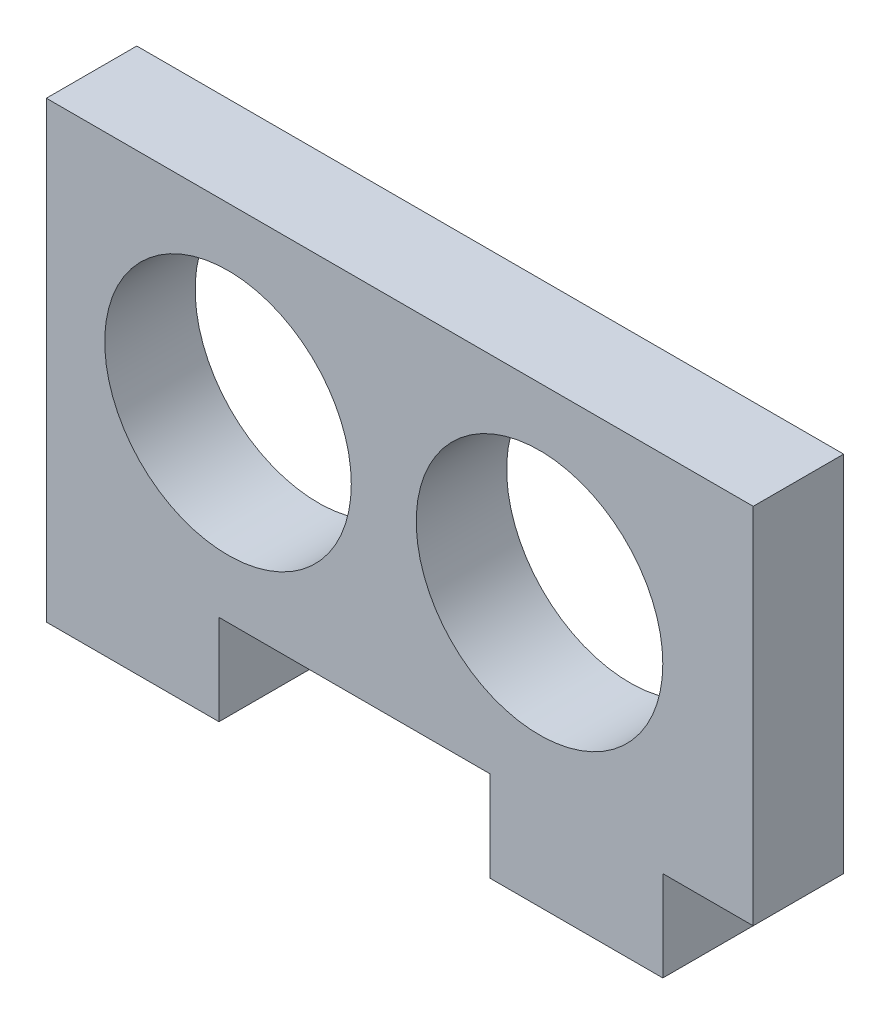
ISO-10303-21;
HEADER;
FILE_DESCRIPTION(('STEP AP214'),'2;1');
FILE_NAME('part.step','',(''),(''),'','','');
FILE_SCHEMA(('AUTOMOTIVE_DESIGN { 1 0 10303 214 1 1 1 1 }'));
ENDSEC;
DATA;
#1=APPLICATION_CONTEXT('core data for automotive mechanical design processes');
#2=APPLICATION_PROTOCOL_DEFINITION('international standard','automotive_design',2000,#1);
#3=PRODUCT_CONTEXT('',#1,'mechanical');
#4=PRODUCT('Part','Part','',(#3));
#5=PRODUCT_RELATED_PRODUCT_CATEGORY('part','',(#4));
#6=PRODUCT_DEFINITION_FORMATION('','',#4);
#7=PRODUCT_DEFINITION_CONTEXT('part definition',#1,'design');
#8=PRODUCT_DEFINITION('design','',#6,#7);
#9=PRODUCT_DEFINITION_SHAPE('','',#8);
#10=(LENGTH_UNIT() NAMED_UNIT(*) SI_UNIT(.MILLI.,.METRE.));
#11=(NAMED_UNIT(*) PLANE_ANGLE_UNIT() SI_UNIT($,.RADIAN.));
#12=(NAMED_UNIT(*) SI_UNIT($,.STERADIAN.) SOLID_ANGLE_UNIT());
#13=UNCERTAINTY_MEASURE_WITH_UNIT(LENGTH_MEASURE(1.E-05),#10,'distance_accuracy_value','');
#14=(GEOMETRIC_REPRESENTATION_CONTEXT(3) GLOBAL_UNCERTAINTY_ASSIGNED_CONTEXT((#13)) GLOBAL_UNIT_ASSIGNED_CONTEXT((#10,
#11,#12)) REPRESENTATION_CONTEXT('',''));
#15=CARTESIAN_POINT('',(0.,0.,0.));
#16=DIRECTION('',(0.,0.,1.));
#17=DIRECTION('',(1.,0.,0.));
#18=AXIS2_PLACEMENT_3D('',#15,#16,#17);
#19=CARTESIAN_POINT('',(0.,0.,5.5));
#20=DIRECTION('',(0.,0.,1.));
#21=DIRECTION('',(1.,0.,0.));
#22=AXIS2_PLACEMENT_3D('',#19,#20,#21);
#23=PLANE('',#22);
#24=CARTESIAN_POINT('',(-26.3312728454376,16.55,5.5));
#25=DIRECTION('',(0.,0.,1.));
#26=DIRECTION('',(1.,0.,0.));
#27=AXIS2_PLACEMENT_3D('',#24,#25,#26);
#28=CIRCLE('',#27,7.5);
#29=CARTESIAN_POINT('',(-18.8312728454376,16.55,5.5));
#30=VERTEX_POINT('',#29);
#31=EDGE_CURVE('E152',#30,#30,#28,.T.);
#32=ORIENTED_EDGE('',*,*,#31,.F.);
#33=EDGE_LOOP('',(#32));
#34=FACE_BOUND('',#33,.T.);
#35=DIRECTION('',(1.,0.,0.));
#36=VECTOR('',#35,1.);
#37=CARTESIAN_POINT('',(0.118727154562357,0.,5.5));
#38=LINE('',#37,#36);
#39=CARTESIAN_POINT('',(-10.3812728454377,0.,5.5));
#40=VERTEX_POINT('',#39);
#41=CARTESIAN_POINT('',(0.118727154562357,0.,5.5));
#42=VERTEX_POINT('',#41);
#43=EDGE_CURVE('E53',#40,#42,#38,.T.);
#44=ORIENTED_EDGE('',*,*,#43,.T.);
#45=DIRECTION('',(0.,1.,0.));
#46=VECTOR('',#45,1.);
#47=CARTESIAN_POINT('',(0.118727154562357,5.5,5.5));
#48=LINE('',#47,#46);
#49=CARTESIAN_POINT('',(0.118727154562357,5.5,5.5));
#50=VERTEX_POINT('',#49);
#51=EDGE_CURVE('E103',#42,#50,#48,.T.);
#52=ORIENTED_EDGE('',*,*,#51,.T.);
#53=DIRECTION('',(1.,0.,0.));
#54=VECTOR('',#53,1.);
#55=CARTESIAN_POINT('',(5.61872715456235,5.5,5.5));
#56=LINE('',#55,#54);
#57=CARTESIAN_POINT('',(5.61872715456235,5.5,5.5));
#58=VERTEX_POINT('',#57);
#59=EDGE_CURVE('E189',#50,#58,#56,.T.);
#60=ORIENTED_EDGE('',*,*,#59,.T.);
#61=DIRECTION('',(0.,1.,0.));
#62=VECTOR('',#61,1.);
#63=CARTESIAN_POINT('',(5.61872715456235,13.3164696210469,5.5));
#64=LINE('',#63,#62);
#65=CARTESIAN_POINT('',(5.61872715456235,27.6,5.5));
#66=VERTEX_POINT('',#65);
#67=EDGE_CURVE('E207',#58,#66,#64,.T.);
#68=ORIENTED_EDGE('',*,*,#67,.T.);
#69=DIRECTION('',(-1.,0.,0.));
#70=VECTOR('',#69,1.);
#71=CARTESIAN_POINT('',(0.11872715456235,27.6,5.5));
#72=LINE('',#71,#70);
#73=CARTESIAN_POINT('',(-37.3812728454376,27.6,5.5));
#74=VERTEX_POINT('',#73);
#75=EDGE_CURVE('E204',#66,#74,#72,.T.);
#76=ORIENTED_EDGE('',*,*,#75,.T.);
#77=DIRECTION('',(0.,-1.,0.));
#78=VECTOR('',#77,1.);
#79=CARTESIAN_POINT('',(-37.3812728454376,27.6,5.5));
#80=LINE('',#79,#78);
#81=CARTESIAN_POINT('',(-37.3812728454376,0.,5.5));
#82=VERTEX_POINT('',#81);
#83=EDGE_CURVE('E206',#74,#82,#80,.T.);
#84=ORIENTED_EDGE('',*,*,#83,.T.);
#85=DIRECTION('',(1.,0.,0.));
#86=VECTOR('',#85,1.);
#87=CARTESIAN_POINT('',(-37.3812728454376,0.,5.5));
#88=LINE('',#87,#86);
#89=CARTESIAN_POINT('',(-26.8812728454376,0.,5.5));
#90=VERTEX_POINT('',#89);
#91=EDGE_CURVE('E129',#82,#90,#88,.T.);
#92=ORIENTED_EDGE('',*,*,#91,.T.);
#93=DIRECTION('',(0.,1.,0.));
#94=VECTOR('',#93,1.);
#95=CARTESIAN_POINT('',(-26.8812728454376,0.,5.5));
#96=LINE('',#95,#94);
#97=CARTESIAN_POINT('',(-26.8812728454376,5.5,5.5));
#98=VERTEX_POINT('',#97);
#99=EDGE_CURVE('E123',#90,#98,#96,.T.);
#100=ORIENTED_EDGE('',*,*,#99,.T.);
#101=DIRECTION('',(1.,0.,0.));
#102=VECTOR('',#101,1.);
#103=CARTESIAN_POINT('',(-26.8812728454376,5.5,5.5));
#104=LINE('',#103,#102);
#105=CARTESIAN_POINT('',(-10.3812728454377,5.5,5.5));
#106=VERTEX_POINT('',#105);
#107=EDGE_CURVE('E127',#98,#106,#104,.T.);
#108=ORIENTED_EDGE('',*,*,#107,.T.);
#109=DIRECTION('',(0.,-1.,0.));
#110=VECTOR('',#109,1.);
#111=CARTESIAN_POINT('',(-10.3812728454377,5.5,5.5));
#112=LINE('',#111,#110);
#113=EDGE_CURVE('E143',#106,#40,#112,.T.);
#114=ORIENTED_EDGE('',*,*,#113,.T.);
#115=EDGE_LOOP('',(#44,#52,#60,#68,#76,#84,#92,#100,#108,#114));
#116=FACE_BOUND('',#115,.T.);
#117=CARTESIAN_POINT('',(-7.38127284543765,16.55,5.5));
#118=DIRECTION('',(0.,0.,1.));
#119=DIRECTION('',(1.,0.,0.));
#120=AXIS2_PLACEMENT_3D('',#117,#118,#119);
#121=CIRCLE('',#120,7.5);
#122=CARTESIAN_POINT('',(0.118727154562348,16.55,5.5));
#123=VERTEX_POINT('',#122);
#124=EDGE_CURVE('E218',#123,#123,#121,.T.);
#125=ORIENTED_EDGE('',*,*,#124,.F.);
#126=EDGE_LOOP('',(#125));
#127=FACE_BOUND('',#126,.T.);
#128=ADVANCED_FACE('F36',(#34,#116,#127),#23,.T.);
#129=CARTESIAN_POINT('',(0.,0.,0.));
#130=DIRECTION('',(0.,0.,1.));
#131=DIRECTION('',(1.,0.,0.));
#132=AXIS2_PLACEMENT_3D('',#129,#130,#131);
#133=PLANE('',#132);
#134=DIRECTION('',(0.,1.,0.));
#135=VECTOR('',#134,1.);
#136=CARTESIAN_POINT('',(0.118727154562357,5.5,0.));
#137=LINE('',#136,#135);
#138=CARTESIAN_POINT('',(0.118727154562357,0.,0.));
#139=VERTEX_POINT('',#138);
#140=CARTESIAN_POINT('',(0.118727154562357,5.5,0.));
#141=VERTEX_POINT('',#140);
#142=EDGE_CURVE('E149',#139,#141,#137,.T.);
#143=ORIENTED_EDGE('',*,*,#142,.F.);
#144=DIRECTION('',(1.,0.,0.));
#145=VECTOR('',#144,1.);
#146=CARTESIAN_POINT('',(-10.3812728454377,0.,0.));
#147=LINE('',#146,#145);
#148=CARTESIAN_POINT('',(-10.3812728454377,0.,0.));
#149=VERTEX_POINT('',#148);
#150=EDGE_CURVE('E167',#149,#139,#147,.T.);
#151=ORIENTED_EDGE('',*,*,#150,.F.);
#152=DIRECTION('',(0.,-1.,0.));
#153=VECTOR('',#152,1.);
#154=CARTESIAN_POINT('',(-10.3812728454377,5.5,0.));
#155=LINE('',#154,#153);
#156=CARTESIAN_POINT('',(-10.3812728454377,5.5,0.));
#157=VERTEX_POINT('',#156);
#158=EDGE_CURVE('E96',#157,#149,#155,.T.);
#159=ORIENTED_EDGE('',*,*,#158,.F.);
#160=DIRECTION('',(1.,0.,0.));
#161=VECTOR('',#160,1.);
#162=CARTESIAN_POINT('',(-26.8812728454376,5.5,0.));
#163=LINE('',#162,#161);
#164=CARTESIAN_POINT('',(-26.8812728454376,5.5,0.));
#165=VERTEX_POINT('',#164);
#166=EDGE_CURVE('E89',#165,#157,#163,.T.);
#167=ORIENTED_EDGE('',*,*,#166,.F.);
#168=DIRECTION('',(0.,1.,0.));
#169=VECTOR('',#168,1.);
#170=CARTESIAN_POINT('',(-26.8812728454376,0.,0.));
#171=LINE('',#170,#169);
#172=CARTESIAN_POINT('',(-26.8812728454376,0.,0.));
#173=VERTEX_POINT('',#172);
#174=EDGE_CURVE('E137',#173,#165,#171,.T.);
#175=ORIENTED_EDGE('',*,*,#174,.F.);
#176=DIRECTION('',(1.,0.,0.));
#177=VECTOR('',#176,1.);
#178=CARTESIAN_POINT('',(-37.3812728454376,0.,0.));
#179=LINE('',#178,#177);
#180=CARTESIAN_POINT('',(-37.3812728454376,0.,0.));
#181=VERTEX_POINT('',#180);
#182=EDGE_CURVE('E162',#181,#173,#179,.T.);
#183=ORIENTED_EDGE('',*,*,#182,.F.);
#184=DIRECTION('',(0.,-1.,0.));
#185=VECTOR('',#184,1.);
#186=CARTESIAN_POINT('',(-37.3812728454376,27.6,0.));
#187=LINE('',#186,#185);
#188=CARTESIAN_POINT('',(-37.3812728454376,27.6,0.));
#189=VERTEX_POINT('',#188);
#190=EDGE_CURVE('E160',#189,#181,#187,.T.);
#191=ORIENTED_EDGE('',*,*,#190,.F.);
#192=DIRECTION('',(-1.,0.,0.));
#193=VECTOR('',#192,1.);
#194=CARTESIAN_POINT('',(-37.3812728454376,27.6,0.));
#195=LINE('',#194,#193);
#196=CARTESIAN_POINT('',(5.61872715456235,27.6,0.));
#197=VERTEX_POINT('',#196);
#198=EDGE_CURVE('E158',#197,#189,#195,.T.);
#199=ORIENTED_EDGE('',*,*,#198,.F.);
#200=DIRECTION('',(0.,1.,0.));
#201=VECTOR('',#200,1.);
#202=CARTESIAN_POINT('',(5.61872715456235,27.6,0.));
#203=LINE('',#202,#201);
#204=CARTESIAN_POINT('',(5.61872715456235,5.5,0.));
#205=VERTEX_POINT('',#204);
#206=EDGE_CURVE('E155',#205,#197,#203,.T.);
#207=ORIENTED_EDGE('',*,*,#206,.F.);
#208=DIRECTION('',(1.,0.,0.));
#209=VECTOR('',#208,1.);
#210=CARTESIAN_POINT('',(5.61872715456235,5.5,0.));
#211=LINE('',#210,#209);
#212=EDGE_CURVE('E151',#141,#205,#211,.T.);
#213=ORIENTED_EDGE('',*,*,#212,.F.);
#214=EDGE_LOOP('',(#143,#151,#159,#167,#175,#183,#191,#199,#207,#213));
#215=FACE_BOUND('',#214,.T.);
#216=CARTESIAN_POINT('',(-26.3312728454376,16.55,0.));
#217=DIRECTION('',(0.,0.,1.));
#218=DIRECTION('',(1.,0.,0.));
#219=AXIS2_PLACEMENT_3D('',#216,#217,#218);
#220=CIRCLE('',#219,7.5);
#221=CARTESIAN_POINT('',(-18.8312728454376,16.55,0.));
#222=VERTEX_POINT('',#221);
#223=EDGE_CURVE('E215',#222,#222,#220,.T.);
#224=ORIENTED_EDGE('',*,*,#223,.T.);
#225=EDGE_LOOP('',(#224));
#226=FACE_BOUND('',#225,.T.);
#227=CARTESIAN_POINT('',(-7.38127284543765,16.55,0.));
#228=DIRECTION('',(0.,0.,1.));
#229=DIRECTION('',(1.,0.,0.));
#230=AXIS2_PLACEMENT_3D('',#227,#228,#229);
#231=CIRCLE('',#230,7.5);
#232=CARTESIAN_POINT('',(0.118727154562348,16.55,0.));
#233=VERTEX_POINT('',#232);
#234=EDGE_CURVE('E221',#233,#233,#231,.T.);
#235=ORIENTED_EDGE('',*,*,#234,.T.);
#236=EDGE_LOOP('',(#235));
#237=FACE_BOUND('',#236,.T.);
#238=ADVANCED_FACE('F192',(#215,#226,#237),#133,.F.);
#239=CARTESIAN_POINT('',(0.118727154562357,5.5,5.5));
#240=DIRECTION('',(-1.,0.,0.));
#241=DIRECTION('',(0.,0.,1.));
#242=AXIS2_PLACEMENT_3D('',#239,#240,#241);
#243=PLANE('',#242);
#244=ORIENTED_EDGE('',*,*,#142,.T.);
#245=DIRECTION('',(0.,0.,-1.));
#246=VECTOR('',#245,1.);
#247=CARTESIAN_POINT('',(0.118727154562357,5.5,5.5));
#248=LINE('',#247,#246);
#249=EDGE_CURVE('E45',#50,#141,#248,.T.);
#250=ORIENTED_EDGE('',*,*,#249,.F.);
#251=ORIENTED_EDGE('',*,*,#51,.F.);
#252=DIRECTION('',(0.,0.,-1.));
#253=VECTOR('',#252,1.);
#254=CARTESIAN_POINT('',(0.118727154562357,0.,5.5));
#255=LINE('',#254,#253);
#256=EDGE_CURVE('E11',#42,#139,#255,.T.);
#257=ORIENTED_EDGE('',*,*,#256,.T.);
#258=EDGE_LOOP('',(#244,#250,#251,#257));
#259=FACE_BOUND('',#258,.T.);
#260=ADVANCED_FACE('F38',(#259),#243,.F.);
#261=CARTESIAN_POINT('',(5.61872715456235,5.5,5.5));
#262=DIRECTION('',(0.,1.,0.));
#263=DIRECTION('',(-1.,0.,0.));
#264=AXIS2_PLACEMENT_3D('',#261,#262,#263);
#265=PLANE('',#264);
#266=ORIENTED_EDGE('',*,*,#212,.T.);
#267=DIRECTION('',(0.,0.,-1.));
#268=VECTOR('',#267,1.);
#269=CARTESIAN_POINT('',(5.61872715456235,5.5,5.5));
#270=LINE('',#269,#268);
#271=EDGE_CURVE('E181',#58,#205,#270,.T.);
#272=ORIENTED_EDGE('',*,*,#271,.F.);
#273=ORIENTED_EDGE('',*,*,#59,.F.);
#274=ORIENTED_EDGE('',*,*,#249,.T.);
#275=EDGE_LOOP('',(#266,#272,#273,#274));
#276=FACE_BOUND('',#275,.T.);
#277=ADVANCED_FACE('F187',(#276),#265,.F.);
#278=CARTESIAN_POINT('',(5.61872715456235,27.6,5.5));
#279=DIRECTION('',(-1.,0.,0.));
#280=DIRECTION('',(0.,-1.,0.));
#281=AXIS2_PLACEMENT_3D('',#278,#279,#280);
#282=PLANE('',#281);
#283=ORIENTED_EDGE('',*,*,#206,.T.);
#284=DIRECTION('',(0.,0.,-1.));
#285=VECTOR('',#284,1.);
#286=CARTESIAN_POINT('',(5.61872715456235,27.6,5.5));
#287=LINE('',#286,#285);
#288=EDGE_CURVE('E178',#66,#197,#287,.T.);
#289=ORIENTED_EDGE('',*,*,#288,.F.);
#290=ORIENTED_EDGE('',*,*,#67,.F.);
#291=ORIENTED_EDGE('',*,*,#271,.T.);
#292=EDGE_LOOP('',(#283,#289,#290,#291));
#293=FACE_BOUND('',#292,.T.);
#294=ADVANCED_FACE('F198',(#293),#282,.F.);
#295=CARTESIAN_POINT('',(-37.3812728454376,27.6,5.5));
#296=DIRECTION('',(0.,-1.,0.));
#297=DIRECTION('',(1.,0.,0.));
#298=AXIS2_PLACEMENT_3D('',#295,#296,#297);
#299=PLANE('',#298);
#300=ORIENTED_EDGE('',*,*,#198,.T.);
#301=DIRECTION('',(0.,0.,-1.));
#302=VECTOR('',#301,1.);
#303=CARTESIAN_POINT('',(-37.3812728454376,27.6,5.5));
#304=LINE('',#303,#302);
#305=EDGE_CURVE('E175',#74,#189,#304,.T.);
#306=ORIENTED_EDGE('',*,*,#305,.F.);
#307=ORIENTED_EDGE('',*,*,#75,.F.);
#308=ORIENTED_EDGE('',*,*,#288,.T.);
#309=EDGE_LOOP('',(#300,#306,#307,#308));
#310=FACE_BOUND('',#309,.T.);
#311=ADVANCED_FACE('F202',(#310),#299,.F.);
#312=CARTESIAN_POINT('',(-37.3812728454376,27.6,5.5));
#313=DIRECTION('',(1.,0.,0.));
#314=DIRECTION('',(0.,0.,-1.));
#315=AXIS2_PLACEMENT_3D('',#312,#313,#314);
#316=PLANE('',#315);
#317=ORIENTED_EDGE('',*,*,#190,.T.);
#318=DIRECTION('',(0.,0.,-1.));
#319=VECTOR('',#318,1.);
#320=CARTESIAN_POINT('',(-37.3812728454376,0.,5.5));
#321=LINE('',#320,#319);
#322=EDGE_CURVE('E172',#82,#181,#321,.T.);
#323=ORIENTED_EDGE('',*,*,#322,.F.);
#324=ORIENTED_EDGE('',*,*,#83,.F.);
#325=ORIENTED_EDGE('',*,*,#305,.T.);
#326=EDGE_LOOP('',(#317,#323,#324,#325));
#327=FACE_BOUND('',#326,.T.);
#328=ADVANCED_FACE('F254',(#327),#316,.F.);
#329=CARTESIAN_POINT('',(-37.3812728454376,0.,5.5));
#330=DIRECTION('',(0.,1.,0.));
#331=DIRECTION('',(-1.,0.,0.));
#332=AXIS2_PLACEMENT_3D('',#329,#330,#331);
#333=PLANE('',#332);
#334=ORIENTED_EDGE('',*,*,#182,.T.);
#335=DIRECTION('',(0.,0.,-1.));
#336=VECTOR('',#335,1.);
#337=CARTESIAN_POINT('',(-26.8812728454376,0.,5.5));
#338=LINE('',#337,#336);
#339=EDGE_CURVE('E138',#90,#173,#338,.T.);
#340=ORIENTED_EDGE('',*,*,#339,.F.);
#341=ORIENTED_EDGE('',*,*,#91,.F.);
#342=ORIENTED_EDGE('',*,*,#322,.T.);
#343=EDGE_LOOP('',(#334,#340,#341,#342));
#344=FACE_BOUND('',#343,.T.);
#345=ADVANCED_FACE('F251',(#344),#333,.F.);
#346=CARTESIAN_POINT('',(-26.8812728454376,0.,5.5));
#347=DIRECTION('',(-1.,0.,0.));
#348=DIRECTION('',(0.,0.,1.));
#349=AXIS2_PLACEMENT_3D('',#346,#347,#348);
#350=PLANE('',#349);
#351=ORIENTED_EDGE('',*,*,#174,.T.);
#352=DIRECTION('',(0.,0.,-1.));
#353=VECTOR('',#352,1.);
#354=CARTESIAN_POINT('',(-26.8812728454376,5.5,5.5));
#355=LINE('',#354,#353);
#356=EDGE_CURVE('E134',#98,#165,#355,.T.);
#357=ORIENTED_EDGE('',*,*,#356,.F.);
#358=ORIENTED_EDGE('',*,*,#99,.F.);
#359=ORIENTED_EDGE('',*,*,#339,.T.);
#360=EDGE_LOOP('',(#351,#357,#358,#359));
#361=FACE_BOUND('',#360,.T.);
#362=ADVANCED_FACE('F135',(#361),#350,.F.);
#363=CARTESIAN_POINT('',(-26.8812728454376,5.5,5.5));
#364=DIRECTION('',(0.,1.,0.));
#365=DIRECTION('',(0.,0.,1.));
#366=AXIS2_PLACEMENT_3D('',#363,#364,#365);
#367=PLANE('',#366);
#368=ORIENTED_EDGE('',*,*,#166,.T.);
#369=DIRECTION('',(0.,0.,-1.));
#370=VECTOR('',#369,1.);
#371=CARTESIAN_POINT('',(-10.3812728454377,5.5,5.5));
#372=LINE('',#371,#370);
#373=EDGE_CURVE('E139',#106,#157,#372,.T.);
#374=ORIENTED_EDGE('',*,*,#373,.F.);
#375=ORIENTED_EDGE('',*,*,#107,.F.);
#376=ORIENTED_EDGE('',*,*,#356,.T.);
#377=EDGE_LOOP('',(#368,#374,#375,#376));
#378=FACE_BOUND('',#377,.T.);
#379=ADVANCED_FACE('F141',(#378),#367,.F.);
#380=CARTESIAN_POINT('',(-10.3812728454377,5.5,5.5));
#381=DIRECTION('',(1.,0.,0.));
#382=DIRECTION('',(0.,0.,-1.));
#383=AXIS2_PLACEMENT_3D('',#380,#381,#382);
#384=PLANE('',#383);
#385=ORIENTED_EDGE('',*,*,#158,.T.);
#386=DIRECTION('',(0.,0.,-1.));
#387=VECTOR('',#386,1.);
#388=CARTESIAN_POINT('',(-10.3812728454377,0.,5.5));
#389=LINE('',#388,#387);
#390=EDGE_CURVE('E145',#40,#149,#389,.T.);
#391=ORIENTED_EDGE('',*,*,#390,.F.);
#392=ORIENTED_EDGE('',*,*,#113,.F.);
#393=ORIENTED_EDGE('',*,*,#373,.T.);
#394=EDGE_LOOP('',(#385,#391,#392,#393));
#395=FACE_BOUND('',#394,.T.);
#396=ADVANCED_FACE('F244',(#395),#384,.F.);
#397=CARTESIAN_POINT('',(-10.3812728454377,0.,5.5));
#398=DIRECTION('',(0.,1.,0.));
#399=DIRECTION('',(-1.,0.,0.));
#400=AXIS2_PLACEMENT_3D('',#397,#398,#399);
#401=PLANE('',#400);
#402=ORIENTED_EDGE('',*,*,#150,.T.);
#403=ORIENTED_EDGE('',*,*,#256,.F.);
#404=ORIENTED_EDGE('',*,*,#43,.F.);
#405=ORIENTED_EDGE('',*,*,#390,.T.);
#406=EDGE_LOOP('',(#402,#403,#404,#405));
#407=FACE_BOUND('',#406,.T.);
#408=ADVANCED_FACE('F241',(#407),#401,.F.);
#409=CARTESIAN_POINT('',(-26.3312728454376,16.55,5.5));
#410=DIRECTION('',(0.,0.,-1.));
#411=DIRECTION('',(-1.,0.,0.));
#412=AXIS2_PLACEMENT_3D('',#409,#410,#411);
#413=CYLINDRICAL_SURFACE('',#412,7.5);
#414=ORIENTED_EDGE('',*,*,#31,.T.);
#415=EDGE_LOOP('',(#414));
#416=FACE_BOUND('',#415,.T.);
#417=ORIENTED_EDGE('',*,*,#223,.F.);
#418=EDGE_LOOP('',(#417));
#419=FACE_BOUND('',#418,.T.);
#420=ADVANCED_FACE('F238',(#416,#419),#413,.F.);
#421=CARTESIAN_POINT('',(-7.38127284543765,16.55,5.5));
#422=DIRECTION('',(0.,0.,-1.));
#423=DIRECTION('',(-1.,0.,0.));
#424=AXIS2_PLACEMENT_3D('',#421,#422,#423);
#425=CYLINDRICAL_SURFACE('',#424,7.5);
#426=ORIENTED_EDGE('',*,*,#124,.T.);
#427=EDGE_LOOP('',(#426));
#428=FACE_BOUND('',#427,.T.);
#429=ORIENTED_EDGE('',*,*,#234,.F.);
#430=EDGE_LOOP('',(#429));
#431=FACE_BOUND('',#430,.T.);
#432=ADVANCED_FACE('F227',(#428,#431),#425,.F.);
#433=CLOSED_SHELL('',(#128,#238,#260,#277,#294,#311,#328,#345,#362,#379,#396,#408,#420,#432));
#434=MANIFOLD_SOLID_BREP('B2',#433);
#435=ADVANCED_BREP_SHAPE_REPRESENTATION('',(#18,#434),#14);
#436=SHAPE_DEFINITION_REPRESENTATION(#9,#435);
ENDSEC;
END-ISO-10303-21;
